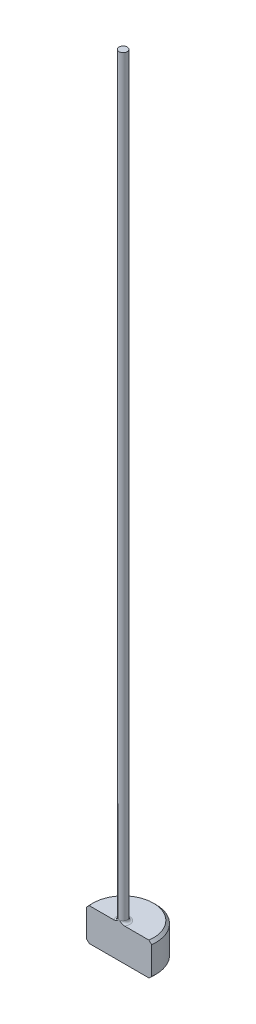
from build123d import *

# Parameters (mm, degrees)
CHAMFER1_SIZE = 0.254
FILLET1_R     = 0.254
KEY_DEPTH     = 77.332177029


with BuildPart() as part:
    # Sketch1 → Revolve1 (revolve)
    with BuildSketch(Plane.XY, mode=Mode.PRIVATE) as revolve1_sk:
        Polygon((0, 0), (-3.175, 0), (-3.175, 3.175), (-0.39624, 3.175), (-0.39624, 76.2), (0, 76.2), align=None)
    revolve(revolve1_sk.sketch.rotate(Axis((0, 259.958771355, 0), (0, -1, 0)), 270), axis=Axis((0, 259.958771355, 0), (0, -1, 0)))

    # Chamfer1
    chamfer1_edges = [part.edges().sort_by_distance(p)[0] for p in [
        (0, 3.175, -3.175),
        (0, 0, -3.175),
    ]]
    chamfer(chamfer1_edges, length=CHAMFER1_SIZE)

    # Fillet1
    fillet1_edges = [part.edges().sort_by_distance(p)[0] for p in [
        (0, 3.175, -0.39624),
    ]]
    fillet(fillet1_edges, radius=FILLET1_R)

    # Sketch2 → Key (cut, through all)
    with BuildSketch(Plane(origin=(0, 0, 0), x_dir=(1, 0, 0), z_dir=(0, 1, 0))):
        with BuildLine():
            Line((-3.150177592, -0.39624), (3.150177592, -0.39624))
            ThreePointArc((3.150177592, -0.39624), (0, -3.175), (-3.150177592, -0.39624))
        make_face()
    extrude(amount=KEY_DEPTH, mode=Mode.SUBTRACT)


solid = part.part
